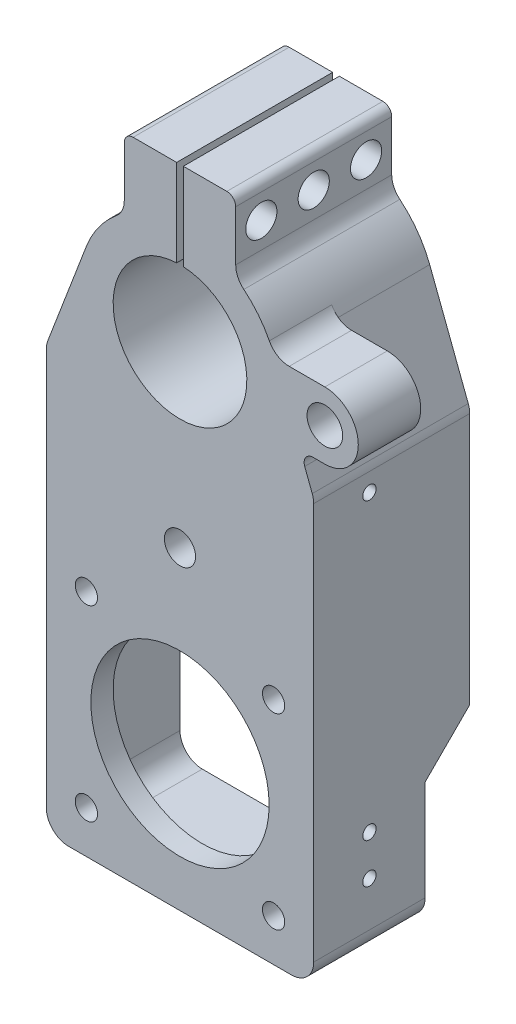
from build123d import *
from build123d.topology import SkipClean

# Parameters (mm, degrees)
SKETCH_1_R          = 40
SKETCH_1_R_2        = 5
SKETCH_1_R_3        = 7
SKETCH_1_R_4        = 30
SKETCH_1_R_5        = 8
EXTRUDE_1_DEPTH     = 28
EXTRUDE_START       = 42
SKETCH_2_R          = 40
SKETCH_2_R_2        = 5
SKETCH_2_R_3        = 7
SKETCH_2_R_4        = 30
EXTRUDE_2_DEPTH     = 42
CUT_EXTRUDE_1_DEPTH = 60
SKETCH_4_W          = 3
SKETCH_4_H          = 97.237431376
CUT_EXTRUDE_2_DEPTH = 60
SKETCH_5_R          = 7
CUT_EXTRUDE_3_DEPTH = 10
CUT_EXTRUDE_4_REACH = 246.602
SKETCH_6_R          = 4.5
CUT_EXTRUDE_5_DEPTH = 120
SKETCH_8_R          = 3
CUT_EXTRUDE_6_DEPTH = 10
SKETCH_9_R          = 2.5
CUT_EXTRUDE_7_DEPTH = 10


with BuildPart() as part:
    # Sketch 1 → Extrude 1 (new body)
    with BuildSketch(Plane.XY):
        with BuildLine():
            Line((60, 127.156313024), (60, -51))
            ThreePointArc((60, -51), (57.071067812, -58.071067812), (50, -61))
            Line((50, -61), (-50, -61))
            ThreePointArc((-50, -61), (-57.071067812, -58.071067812), (-60, -51))
            Line((-60, -51), (-60, 127.156313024))
            ThreePointArc((-60, 127.156313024), (-59.834254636, 128.969441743), (-59.34251285, 130.722466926))
            Line((-59.34251285, 130.722466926), (-42.041307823, 176.047692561))
            ThreePointArc((-42.041307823, 176.047692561), (-36.550337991, 186.250196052), (-28.636363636, 194.712514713))
            ThreePointArc((-28.636363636, 194.712514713), (-25.954659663, 198.162392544), (-25, 202.426406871))
            Line((-25, 202.426406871), (-25, 225.016696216))
            ThreePointArc((-25, 225.016696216), (-23.833317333, 227.833317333), (-21.016696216, 229))
            Line((-21.016696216, 229), (0, 229))
            Line((0, 229), (21.016696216, 229))
            ThreePointArc((21.016696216, 229), (23.833317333, 227.833317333), (25, 225.016696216))
            Line((25, 225.016696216), (25, 202.426406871))
            ThreePointArc((25, 202.426406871), (25.954659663, 198.162392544), (28.636363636, 194.712514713))
            ThreePointArc((28.636363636, 194.712514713), (35.091238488, 188.170995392), (40.082559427, 180.454545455))
            ThreePointArc((40.082559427, 180.454545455), (43.767465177, 176.471971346), (48.989794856, 175))
            Line((48.989794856, 175), (65, 175))
            ThreePointArc((65, 175), (80, 160), (65, 145))
            Line((65, 145), (59.676709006, 145))
            ThreePointArc((59.676709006, 145), (56.396082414, 143.27594348), (55.955302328, 139.596188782))
            Line((55.955302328, 139.596188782), (59.34251285, 130.722466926))
            ThreePointArc((59.34251285, 130.722466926), (59.834254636, 128.969441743), (60, 127.156313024))
        make_face()
        Circle(SKETCH_1_R, mode=Mode.SUBTRACT)
        with Locations((-42, -42)):
            Circle(SKETCH_1_R_2, mode=Mode.SUBTRACT)
        with Locations((-42, 42)):
            Circle(SKETCH_1_R_2, mode=Mode.SUBTRACT)
        with Locations((0, 80)):
            Circle(SKETCH_1_R_3, mode=Mode.SUBTRACT)
        with Locations((0, 160)):
            Circle(SKETCH_1_R_4, mode=Mode.SUBTRACT)
        with Locations((42, -42)):
            Circle(SKETCH_1_R_2, mode=Mode.SUBTRACT)
        with Locations((42, 42)):
            Circle(SKETCH_1_R_2, mode=Mode.SUBTRACT)
        with Locations((65, 160)):
            Circle(SKETCH_1_R_5, mode=Mode.SUBTRACT)
    extrude(amount=EXTRUDE_1_DEPTH)

    # Sketch 2 → Extrude 2 (add)
    with SkipClean():  # the faces are left unmerged after this step: merging them gives an invalid solid
        with BuildSketch(Plane(origin=(0, 0, 0), x_dir=(-1, 0, 0), z_dir=(0, 0, -1)).offset(EXTRUDE_START)):
            with BuildLine():
                Line((-50, -61), (50, -61))
                ThreePointArc((50, -61), (57.071067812, -58.071067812), (60, -51))
                Line((60, -51), (60, 127.156313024))
                ThreePointArc((60, 127.156313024), (59.834254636, 128.969441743), (59.34251285, 130.722466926))
                Line((59.34251285, 130.722466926), (42.041307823, 176.047692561))
                ThreePointArc((42.041307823, 176.047692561), (36.550337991, 186.250196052), (28.636363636, 194.712514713))
                ThreePointArc((28.636363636, 194.712514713), (25.954659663, 198.162392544), (25, 202.426406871))
                Line((25, 202.426406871), (25, 225.016696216))
                ThreePointArc((25, 225.016696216), (23.833317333, 227.833317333), (21.016696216, 229))
                Line((21.016696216, 229), (-21.016696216, 229))
                ThreePointArc((-21.016696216, 229), (-23.833317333, 227.833317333), (-25, 225.016696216))
                Line((-25, 225.016696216), (-25, 202.426406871))
                ThreePointArc((-25, 202.426406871), (-25.954659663, 198.162392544), (-28.636363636, 194.712514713))
                ThreePointArc((-28.636363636, 194.712514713), (-36.550337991, 186.250196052), (-42.041307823, 176.047692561))
                Line((-42.041307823, 176.047692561), (-59.34251285, 130.722466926))
                ThreePointArc((-59.34251285, 130.722466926), (-59.834254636, 128.969441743), (-60, 127.156313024))
                Line((-60, 127.156313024), (-60, -51))
                ThreePointArc((-60, -51), (-57.071067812, -58.071067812), (-50, -61))
            make_face()
            Circle(SKETCH_2_R, mode=Mode.SUBTRACT)
            with Locations((-42, 42)):
                Circle(SKETCH_2_R_2, mode=Mode.SUBTRACT)
            with Locations((0, 80)):
                Circle(SKETCH_2_R_3, mode=Mode.SUBTRACT)
            with Locations((42, 42)):
                Circle(SKETCH_2_R_2, mode=Mode.SUBTRACT)
            with Locations((42, -42)):
                Circle(SKETCH_2_R_2, mode=Mode.SUBTRACT)
            with Locations((-42, -42)):
                Circle(SKETCH_2_R_2, mode=Mode.SUBTRACT)
            with Locations((0, 160)):
                Circle(SKETCH_2_R_4, mode=Mode.SUBTRACT)
        extrude(amount=-EXTRUDE_2_DEPTH)

    # Sketch 3 → Cut-Extrude 1 (cut)
    with SkipClean():  # the faces are left unmerged after this step: merging them gives an invalid solid
        with BuildSketch(Plane(origin=(0, 0, -42), x_dir=(-1, 0, 0), z_dir=(0, 0, -1))):
            with BuildLine():
                Line((50, 128.073304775), (50, -41))
                ThreePointArc((50, -41), (47.071067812, -48.071067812), (40, -51))
                Line((40, -51), (-40, -51))
                ThreePointArc((-40, -51), (-47.071067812, -48.071067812), (-50, -41))
                Line((-50, -41), (-50, 128.073304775))
                ThreePointArc((-50, 128.073304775), (-49.916274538, 128.984482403), (-49.667902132, 129.865144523))
                Line((-49.667902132, 129.865144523), (-47.386419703, 135.808609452))
                ThreePointArc((-47.386419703, 135.808609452), (-43.167758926, 138.996547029), (-38.446665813, 136.615092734))
                ThreePointArc((-38.446665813, 136.615092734), (0, 115), (38.446665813, 136.615092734))
                ThreePointArc((38.446665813, 136.615092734), (43.167758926, 138.996547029), (47.386419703, 135.808609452))
                Line((47.386419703, 135.808609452), (49.667902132, 129.865144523))
                ThreePointArc((49.667902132, 129.865144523), (49.916274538, 128.984482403), (50, 128.073304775))
            make_face()
        extrude(amount=-CUT_EXTRUDE_1_DEPTH, mode=Mode.SUBTRACT)

    # Sketch 4 → Cut-Extrude 2 (cut)
    with BuildSketch(Plane(origin=(0, 229, 0), x_dir=(1, 0, 0), z_dir=(0, 1, 0))):
        Rectangle(SKETCH_4_W, SKETCH_4_H)
    extrude(amount=-CUT_EXTRUDE_2_DEPTH, mode=Mode.SUBTRACT)

    # Sketch 5 → Cut-Extrude 3 (cut)
    with BuildSketch(Plane(origin=(25, 0, 0), x_dir=(0, 0, -1), z_dir=(1, 0, 0))):
        with Locations(Location((7, 214, 0), (0, 0, 90))):
            Circle(SKETCH_5_R)
        with Locations(Location((30.5, 214, 0), (0, 0, 90))):
            Circle(SKETCH_5_R)
        with Locations(Location((-16.5, 214, 0), (0, 0, 90))):
            Circle(SKETCH_5_R)
    extrude(amount=-CUT_EXTRUDE_3_DEPTH, mode=Mode.SUBTRACT)

    # Cut-Extrude 4: up to this face of the body (flat: up to its plane)
    cut_extrude_4_end = Plane(part.part.faces().sort_by_distance((-25, 213.721551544, -7))[0])
    # Sketch 6 → Cut-Extrude 4 (cut, up to the picked face)
    with BuildSketch(Plane(origin=(15, 0, 0), x_dir=(0, 0, -1), z_dir=(1, 0, 0)), mode=Mode.PRIVATE) as cut_extrude_4_sk1:
        with Locations(Location((-16.5, 214, 0), (0, 0, 90))):
            Circle(SKETCH_6_R)
    cut_extrude_4_tool1 = split(extrude(cut_extrude_4_sk1.sketch, amount=-CUT_EXTRUDE_4_REACH, mode=Mode.PRIVATE), bisect_by=cut_extrude_4_end, keep=Keep.BOTH, mode=Mode.PRIVATE)
    # Sketch 6 → Cut-Extrude 4 (cut, up to the picked face)
    with BuildSketch(Plane(origin=(15, 0, 0), x_dir=(0, 0, -1), z_dir=(1, 0, 0)), mode=Mode.PRIVATE) as cut_extrude_4_sk2:
        with Locations(Location((7, 214, 0), (0, 0, 90))):
            Circle(SKETCH_6_R)
    cut_extrude_4_tool2 = split(extrude(cut_extrude_4_sk2.sketch, amount=-CUT_EXTRUDE_4_REACH, mode=Mode.PRIVATE), bisect_by=cut_extrude_4_end, keep=Keep.BOTH, mode=Mode.PRIVATE)
    # Sketch 6 → Cut-Extrude 4 (cut, up to the picked face)
    with BuildSketch(Plane(origin=(15, 0, 0), x_dir=(0, 0, -1), z_dir=(1, 0, 0)), mode=Mode.PRIVATE) as cut_extrude_4_sk3:
        with Locations(Location((30.5, 214, 0), (0, 0, 90))):
            Circle(SKETCH_6_R)
    cut_extrude_4_tool3 = split(extrude(cut_extrude_4_sk3.sketch, amount=-CUT_EXTRUDE_4_REACH, mode=Mode.PRIVATE), bisect_by=cut_extrude_4_end, keep=Keep.BOTH, mode=Mode.PRIVATE)
    add(cut_extrude_4_tool1.solids().sort_by(Axis((15, 214, 16.5), (-1, 0, 0)))[0], mode=Mode.SUBTRACT)
    add(cut_extrude_4_tool2.solids().sort_by(Axis((15, 214, -7), (-1, 0, 0)))[0], mode=Mode.SUBTRACT)
    add(cut_extrude_4_tool3.solids().sort_by(Axis((15, 214, -30.5), (-1, 0, 0)))[0], mode=Mode.SUBTRACT)

    # Sketch 7 → Cut-Extrude 5 (cut)
    with BuildSketch(Plane(origin=(60, 0, 0), x_dir=(0, 0, -1), z_dir=(1, 0, 0))):
        Polygon((22, -61), (42, -61), (42, 14), (22, -6), align=None)
    extrude(amount=-CUT_EXTRUDE_5_DEPTH, mode=Mode.SUBTRACT)

    # Sketch 8 → Cut-Extrude 6 (cut)
    with BuildSketch(Plane(origin=(60, 0, 0), x_dir=(0, 0, -1), z_dir=(1, 0, 0))):
        with Locations(Location((-3, -31, 0), (0, 0, 90))):
            Circle(SKETCH_8_R)
        with Locations(Location((-3, -13, 0), (0, 0, 90))):
            Circle(SKETCH_8_R)
        with Locations(Location((-3, 119, 0), (0, 0, 90))):
            Circle(SKETCH_8_R)
    extrude(amount=-CUT_EXTRUDE_6_DEPTH, mode=Mode.SUBTRACT)

    # Sketch 9 → Cut-Extrude 7 (cut)
    with BuildSketch(Plane(origin=(-95.348249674, 36.39561841, 0), x_dir=(0, 0, 1), z_dir=(-0.9342512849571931, 0.3566153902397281, 0))):
        with Locations(Location((-2, 136.480205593, 0), (0, 0, 270))):
            Circle(SKETCH_9_R)
        with Locations(Location((-2, 114.480205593, 0), (0, 0, 270))):
            Circle(SKETCH_9_R)
    extrude(amount=-CUT_EXTRUDE_7_DEPTH, mode=Mode.SUBTRACT)


solid = part.part
